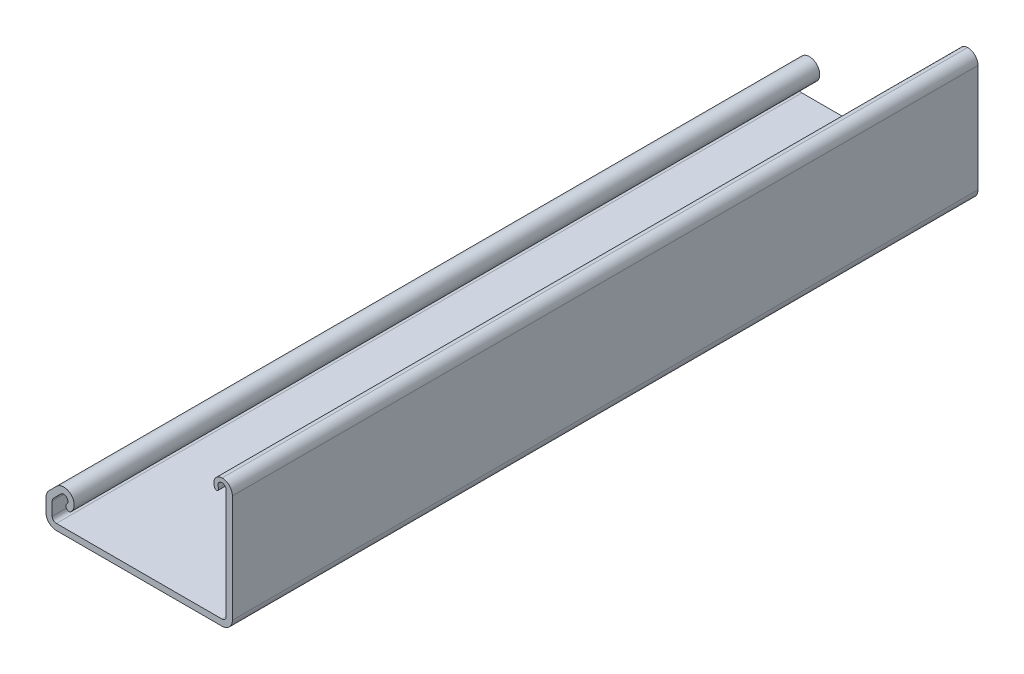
from build123d import *

# Parameters (mm, degrees)
EXTRUDE1_DEPTH      = 90
EXTRUDE1_DEPTH_BACK = 90


with BuildPart() as part:
    # Sketch1 → Extrude1 (new, two sides: drawn at the far end of the back side and taken through both)
    with BuildSketch(Plane.XY.offset(-EXTRUDE1_DEPTH_BACK)):
        with BuildLine():
            Line((-45, 5.69962915), (-45, 2.5))
            ThreePointArc((-45, 2.5), (-44.267766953, 0.732233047), (-42.5, 0))
            Line((-42.5, 0), (-2.5, 0))
            ThreePointArc((-2.5, 0), (-0.732233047, 0.732233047), (0, 2.5))
            Line((0, 2.5), (0, 28.5))
            ThreePointArc((0, 28.5), (-0.732233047, 30.267766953), (-2.5, 31))
            ThreePointArc((-2.5, 31), (-4.224707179, 30.012613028), (-4.24646096, 28.025385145))
            ThreePointArc((-4.24646096, 28.025385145), (-3.566192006, 27.832423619), (-3.37323048, 28.512692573))
            ThreePointArc((-3.37323048, 28.512692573), (-2.751763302, 29.967788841), (-1.5, 29))
            Line((-1.5, 29), (-1.5, 2.5))
            ThreePointArc((-1.5, 2.5), (-1.792893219, 1.792893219), (-2.5, 1.5))
            Line((-2.5, 1.5), (-42.5, 1.5))
            ThreePointArc((-42.5, 1.5), (-43.207106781, 1.792893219), (-43.5, 2.5))
            Line((-43.5, 2.5), (-43.5, 5.69962915))
            ThreePointArc((-43.5, 5.69962915), (-43.423879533, 6.082312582), (-43.207106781, 6.406735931))
            Line((-43.207106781, 6.406735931), (-41.406735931, 8.207106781))
            ThreePointArc((-41.406735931, 8.207106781), (-39.992522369, 8.207106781), (-39.992522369, 6.792893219))
            ThreePointArc((-39.992522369, 6.792893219), (-39.992522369, 5.732233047), (-38.931862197, 5.732233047))
            ThreePointArc((-38.931862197, 5.732233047), (-38.931862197, 9.267766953), (-42.467396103, 9.267766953))
            Line((-42.467396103, 9.267766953), (-44.267766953, 7.467396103))
            ThreePointArc((-44.267766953, 7.467396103), (-44.809698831, 6.656337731), (-45, 5.69962915))
        make_face()
    extrude(amount=EXTRUDE1_DEPTH + EXTRUDE1_DEPTH_BACK)


solid = part.part
